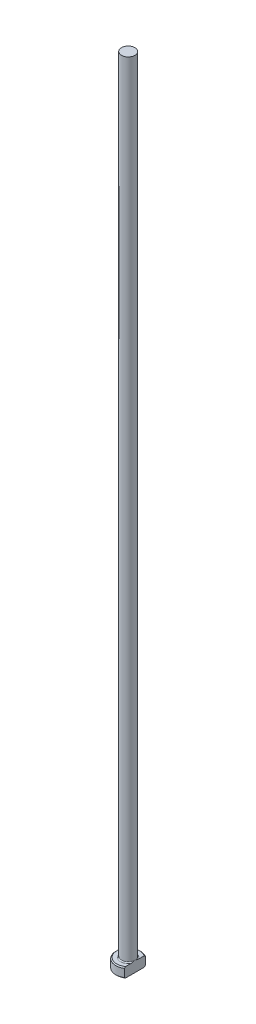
from build123d import *
from build123d.topology import SkipClean

# Parameters (mm, degrees)
CHAMFER1_SIZE = 0.2
FILLET1_R     = 0.2
KEY_DEPTH     = 161.039057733


with BuildPart() as part:
    # Sketch1 → Revolve1 (revolve)
    with BuildSketch(Plane.XY, mode=Mode.PRIVATE) as revolve1_sk:
        Polygon((0, 0), (-2.5, 0), (-2.5, 2), (-1.35, 2), (-1.35, 160), (0, 160), align=None)
    revolve(revolve1_sk.sketch.rotate(Axis((0, 259.958771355, 0), (0, -1, 0)), 270), axis=Axis((0, 259.958771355, 0), (0, -1, 0)))

    # Chamfer1
    chamfer1_edges = [part.edges().sort_by_distance(p)[0] for p in [
        (0, 2, -2.5),
        (0, 0, -2.5),
    ]]
    chamfer(chamfer1_edges, length=CHAMFER1_SIZE)

    # Fillet1
    fillet1_edges = [part.edges().sort_by_distance(p)[0] for p in [
        (0, 2, -1.35),
    ]]
    fillet(fillet1_edges, radius=FILLET1_R)

    # Sketch2 → KEY (cut, through all)
    with SkipClean():  # the faces are left unmerged after this step: merging them gives an invalid solid
        with BuildSketch(Plane(origin=(0, 0, 0), x_dir=(1, 0, 0), z_dir=(0, 1, 0))):
            with BuildLine():
                Line((1.35, 2.104162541), (1.35, -2.104162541))
                ThreePointArc((1.35, -2.104162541), (2.5, 0), (1.35, 2.104162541))
            make_face()
        extrude(amount=KEY_DEPTH, mode=Mode.SUBTRACT)


solid = part.part
